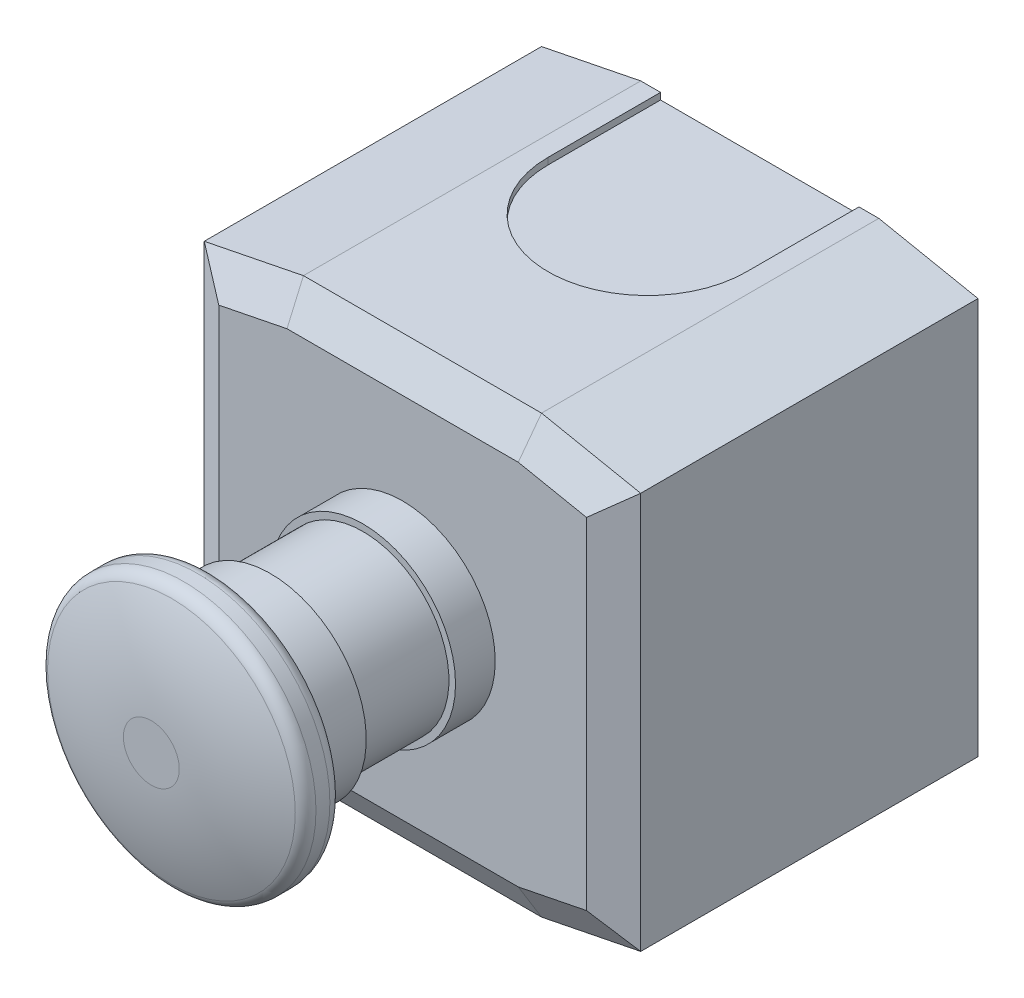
from build123d import *
from OCP.BRepFilletAPI import BRepFilletAPI_MakeChamfer

# Parameters (mm, degrees)
EXTRUSION1_DEPTH        = 54
CHANFREIN1_SIZE         = 3
CHANFREIN1_SIZE2        = 5.196152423
ENL_V_MAT_EXTRU_1_DEPTH = 1
ESQUISSE5_R             = 2.15
ENL_V_MAT_EXTRU_2_DEPTH = 10


with BuildPart() as part:
    # Esquisse1 → Extrusion1 (new body)
    with BuildSketch(Plane.XY):
        Polygon((-18, 33), (-33, 30), (-33, -30), (-18, -33), (18, -33), (33, -30), (33, 30), (18, 33), align=None)
    extrude(amount=EXTRUSION1_DEPTH)

    # Chanfrein1: one chamfer whose edges measure the first distance from different faces: ONE call of the kernel's chamfer builder (chamfer() names one face for all edges)
    chanfrein1_edges_1 = [part.edges().sort_by_distance(p)[0] for p in [
        (-33, 0, 54),
    ]]
    chanfrein1_side_1 = [part.faces().sort_by_distance(p)[0] for p in [
        (-33, 0, 27),
    ]]
    chanfrein1_edges_2 = [part.edges().sort_by_distance(p)[0] for p in [
        (-25.5, -31.5, 54),
    ]]
    chanfrein1_side_2 = [part.faces().sort_by_distance(p)[0] for p in [
        (-25.5, -31.5, 27),
    ]]
    chanfrein1_edges_3 = [part.edges().sort_by_distance(p)[0] for p in [
        (0, -33, 54),
    ]]
    chanfrein1_side_3 = [part.faces().sort_by_distance(p)[0] for p in [
        (0, -33, 27),
    ]]
    chanfrein1_edges_4 = [part.edges().sort_by_distance(p)[0] for p in [
        (25.5, -31.5, 54),
    ]]
    chanfrein1_side_4 = [part.faces().sort_by_distance(p)[0] for p in [
        (25.5, -31.5, 27),
    ]]
    chanfrein1_edges_5 = [part.edges().sort_by_distance(p)[0] for p in [
        (33, 0, 54),
    ]]
    chanfrein1_side_5 = [part.faces().sort_by_distance(p)[0] for p in [
        (33, 0, 27),
    ]]
    chanfrein1_edges_6 = [part.edges().sort_by_distance(p)[0] for p in [
        (25.5, 31.5, 54),
    ]]
    chanfrein1_side_6 = [part.faces().sort_by_distance(p)[0] for p in [
        (25.5, 31.5, 27),
    ]]
    chanfrein1_edges_7 = [part.edges().sort_by_distance(p)[0] for p in [
        (0, 33, 54),
    ]]
    chanfrein1_side_7 = [part.faces().sort_by_distance(p)[0] for p in [
        (0, 33, 27),
    ]]
    chanfrein1_edges_8 = [part.edges().sort_by_distance(p)[0] for p in [
        (-25.5, 31.5, 54),
    ]]
    chanfrein1_side_8 = [part.faces().sort_by_distance(p)[0] for p in [
        (-25.5, 31.5, 27),
    ]]
    chanfrein1 = BRepFilletAPI_MakeChamfer(part.part.solid().wrapped)
    for e in chanfrein1_edges_1:
        chanfrein1.Add(CHANFREIN1_SIZE, CHANFREIN1_SIZE2, e.wrapped, chanfrein1_side_1[0].wrapped)  # the first distance lies on this face
    for e in chanfrein1_edges_2:
        chanfrein1.Add(CHANFREIN1_SIZE, CHANFREIN1_SIZE2, e.wrapped, chanfrein1_side_2[0].wrapped)  # the first distance lies on this face
    for e in chanfrein1_edges_3:
        chanfrein1.Add(CHANFREIN1_SIZE, CHANFREIN1_SIZE2, e.wrapped, chanfrein1_side_3[0].wrapped)  # the first distance lies on this face
    for e in chanfrein1_edges_4:
        chanfrein1.Add(CHANFREIN1_SIZE, CHANFREIN1_SIZE2, e.wrapped, chanfrein1_side_4[0].wrapped)  # the first distance lies on this face
    for e in chanfrein1_edges_5:
        chanfrein1.Add(CHANFREIN1_SIZE, CHANFREIN1_SIZE2, e.wrapped, chanfrein1_side_5[0].wrapped)  # the first distance lies on this face
    for e in chanfrein1_edges_6:
        chanfrein1.Add(CHANFREIN1_SIZE, CHANFREIN1_SIZE2, e.wrapped, chanfrein1_side_6[0].wrapped)  # the first distance lies on this face
    for e in chanfrein1_edges_7:
        chanfrein1.Add(CHANFREIN1_SIZE, CHANFREIN1_SIZE2, e.wrapped, chanfrein1_side_7[0].wrapped)  # the first distance lies on this face
    for e in chanfrein1_edges_8:
        chanfrein1.Add(CHANFREIN1_SIZE, CHANFREIN1_SIZE2, e.wrapped, chanfrein1_side_8[0].wrapped)  # the first distance lies on this face
    add(Compound.cast(chanfrein1.Shape()), mode=Mode.REPLACE)

    # Esquisse2 → Enl_v. mat.-Extru.1 (cut)
    with BuildSketch(Plane.XZ.offset(33)):
        with BuildLine():
            Line((15, 17), (15, 0))
            Line((15, 0), (-15, 0))
            Line((-15, 0), (-15, 17))
            ThreePointArc((-15, 17), (0, 32), (15, 17))
        make_face()
    enl_v_mat_extru_1 = extrude(amount=-ENL_V_MAT_EXTRU_1_DEPTH, mode=Mode.SUBTRACT)

    # Sym_trie1: Enl_v. mat.-Extru.1 across plane
    add(enl_v_mat_extru_1.mirror(Plane.ZX), mode=Mode.SUBTRACT)

    # Esquisse4 → R_volution1 (revolve)
    with BuildSketch(Plane(origin=(0, 0, 0), x_dir=(0, 0, -1), z_dir=(1, 0, 0)), mode=Mode.PRIVATE) as r_volution1_sk:
        with BuildLine():
            Line((-54, 14), (-60, 14))
            Line((-60, 14), (-60, 13))
            Line((-60, 13), (-74, 13))
            Line((-74, 13), (-74, 14.5))
            Line((-74, 14.5), (-83, 14.5))
            Line((-83, 14.5), (-83, 18))
            ThreePointArc((-83, 18), (-83.585786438, 19.414213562), (-85, 20))
            Line((-85, 20), (-87.102801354, 20))
            ThreePointArc((-87.102801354, 20), (-88.229761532, 19.652259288), (-88.964831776, 18.729960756))
            ThreePointArc((-88.964831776, 18.729960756), (-91.090608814, 11.604929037), (-92, 4.225361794))
            Line((-92, 4.225361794), (-92, 0))
            Line((-92, 0), (-54, 0))
            Line((-54, 0), (-54, 14))
        make_face()
    revolve(r_volution1_sk.sketch.rotate(Axis((0, 0, 0), (0, 0, 1)), 90), axis=Axis((0, 0, 0), (0, 0, 1)))

    # Esquisse5 → Enl_v. mat.-Extru.2 (cut)
    with BuildSketch(Plane(origin=(0, 0, 0), x_dir=(-1, 0, 0), z_dir=(0, 0, -1))):
        with Locations((-27, 0)):
            Circle(ESQUISSE5_R)
        with Locations((27, 0)):
            Circle(ESQUISSE5_R)
    extrude(amount=-ENL_V_MAT_EXTRU_2_DEPTH, mode=Mode.SUBTRACT)


solid = part.part
